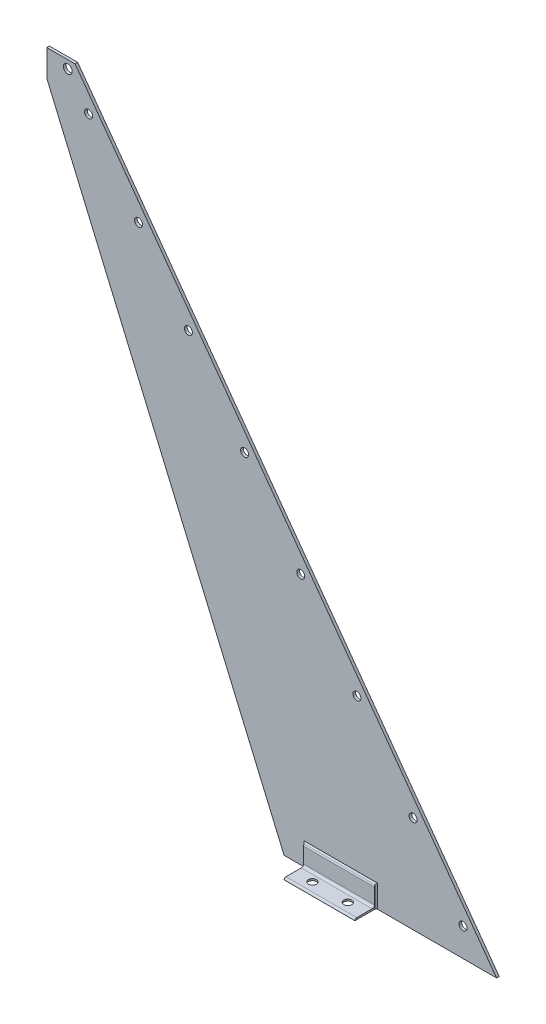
ISO-10303-21;
HEADER;
FILE_DESCRIPTION(('STEP AP214'),'2;1');
FILE_NAME('part.step','',(''),(''),'','','');
FILE_SCHEMA(('AUTOMOTIVE_DESIGN { 1 0 10303 214 1 1 1 1 }'));
ENDSEC;
DATA;
#1=APPLICATION_CONTEXT('core data for automotive mechanical design processes');
#2=APPLICATION_PROTOCOL_DEFINITION('international standard','automotive_design',2000,#1);
#3=PRODUCT_CONTEXT('',#1,'mechanical');
#4=PRODUCT('Part','Part','',(#3));
#5=PRODUCT_RELATED_PRODUCT_CATEGORY('part','',(#4));
#6=PRODUCT_DEFINITION_FORMATION('','',#4);
#7=PRODUCT_DEFINITION_CONTEXT('part definition',#1,'design');
#8=PRODUCT_DEFINITION('design','',#6,#7);
#9=PRODUCT_DEFINITION_SHAPE('','',#8);
#10=(LENGTH_UNIT() NAMED_UNIT(*) SI_UNIT(.MILLI.,.METRE.));
#11=(NAMED_UNIT(*) PLANE_ANGLE_UNIT() SI_UNIT($,.RADIAN.));
#12=(NAMED_UNIT(*) SI_UNIT($,.STERADIAN.) SOLID_ANGLE_UNIT());
#13=UNCERTAINTY_MEASURE_WITH_UNIT(LENGTH_MEASURE(1.E-05),#10,'distance_accuracy_value','');
#14=(GEOMETRIC_REPRESENTATION_CONTEXT(3) GLOBAL_UNCERTAINTY_ASSIGNED_CONTEXT((#13)) GLOBAL_UNIT_ASSIGNED_CONTEXT((#10,
#11,#12)) REPRESENTATION_CONTEXT('',''));
#15=CARTESIAN_POINT('',(0.,0.,0.));
#16=DIRECTION('',(0.,0.,1.));
#17=DIRECTION('',(1.,0.,0.));
#18=AXIS2_PLACEMENT_3D('',#15,#16,#17);
#19=CARTESIAN_POINT('',(0.,0.,0.));
#20=DIRECTION('',(0.,0.,-1.));
#21=DIRECTION('',(-1.,0.,0.));
#22=AXIS2_PLACEMENT_3D('',#19,#20,#21);
#23=PLANE('',#22);
#24=CARTESIAN_POINT('',(1492.55962975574,100.97309190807,0.));
#25=DIRECTION('',(0.,0.,1.));
#26=DIRECTION('',(1.,0.,0.));
#27=AXIS2_PLACEMENT_3D('',#24,#25,#26);
#28=CIRCLE('',#27,14.2874999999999);
#29=CARTESIAN_POINT('',(1506.84712975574,100.97309190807,0.));
#30=VERTEX_POINT('',#29);
#31=EDGE_CURVE('E615',#30,#30,#28,.T.);
#32=ORIENTED_EDGE('',*,*,#31,.F.);
#33=EDGE_LOOP('',(#32));
#34=FACE_BOUND('',#33,.T.);
#35=CARTESIAN_POINT('',(1313.55332901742,347.670850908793,0.));
#36=DIRECTION('',(0.,0.,1.));
#37=DIRECTION('',(1.,0.,0.));
#38=AXIS2_PLACEMENT_3D('',#35,#36,#37);
#39=CIRCLE('',#38,14.2874999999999);
#40=CARTESIAN_POINT('',(1327.84082901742,347.670850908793,0.));
#41=VERTEX_POINT('',#40);
#42=EDGE_CURVE('E609',#41,#41,#39,.T.);
#43=ORIENTED_EDGE('',*,*,#42,.F.);
#44=EDGE_LOOP('',(#43));
#45=FACE_BOUND('',#44,.T.);
#46=CARTESIAN_POINT('',(1112.17124068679,625.205829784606,0.));
#47=DIRECTION('',(0.,0.,1.));
#48=DIRECTION('',(1.,0.,0.));
#49=AXIS2_PLACEMENT_3D('',#46,#47,#48);
#50=CIRCLE('',#49,14.2874999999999);
#51=CARTESIAN_POINT('',(1126.45874068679,625.205829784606,0.));
#52=VERTEX_POINT('',#51);
#53=EDGE_CURVE('E603',#52,#52,#50,.T.);
#54=ORIENTED_EDGE('',*,*,#53,.F.);
#55=EDGE_LOOP('',(#54));
#56=FACE_BOUND('',#55,.T.);
#57=CARTESIAN_POINT('',(910.789152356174,902.74080866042,0.));
#58=DIRECTION('',(0.,0.,1.));
#59=DIRECTION('',(1.,0.,0.));
#60=AXIS2_PLACEMENT_3D('',#57,#58,#59);
#61=CIRCLE('',#60,14.2875);
#62=CARTESIAN_POINT('',(925.076652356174,902.74080866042,0.));
#63=VERTEX_POINT('',#62);
#64=EDGE_CURVE('E597',#63,#63,#61,.T.);
#65=ORIENTED_EDGE('',*,*,#64,.F.);
#66=EDGE_LOOP('',(#65));
#67=FACE_BOUND('',#66,.T.);
#68=CARTESIAN_POINT('',(709.407064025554,1180.27578753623,0.));
#69=DIRECTION('',(0.,0.,1.));
#70=DIRECTION('',(1.,0.,0.));
#71=AXIS2_PLACEMENT_3D('',#68,#69,#70);
#72=CIRCLE('',#71,14.2875);
#73=CARTESIAN_POINT('',(723.694564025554,1180.27578753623,0.));
#74=VERTEX_POINT('',#73);
#75=EDGE_CURVE('E591',#74,#74,#72,.T.);
#76=ORIENTED_EDGE('',*,*,#75,.F.);
#77=EDGE_LOOP('',(#76));
#78=FACE_BOUND('',#77,.T.);
#79=CARTESIAN_POINT('',(508.024975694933,1457.81076641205,0.));
#80=DIRECTION('',(0.,0.,1.));
#81=DIRECTION('',(1.,0.,0.));
#82=AXIS2_PLACEMENT_3D('',#79,#80,#81);
#83=CIRCLE('',#82,14.2875);
#84=CARTESIAN_POINT('',(522.312475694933,1457.81076641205,0.));
#85=VERTEX_POINT('',#84);
#86=EDGE_CURVE('E585',#85,#85,#83,.T.);
#87=ORIENTED_EDGE('',*,*,#86,.F.);
#88=EDGE_LOOP('',(#87));
#89=FACE_BOUND('',#88,.T.);
#90=CARTESIAN_POINT('',(150.012374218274,1951.20628441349,0.));
#91=DIRECTION('',(0.,0.,1.));
#92=DIRECTION('',(1.,0.,0.));
#93=AXIS2_PLACEMENT_3D('',#90,#91,#92);
#94=CIRCLE('',#93,14.2875);
#95=CARTESIAN_POINT('',(164.299874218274,1951.20628441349,0.));
#96=VERTEX_POINT('',#95);
#97=EDGE_CURVE('E579',#96,#96,#94,.T.);
#98=ORIENTED_EDGE('',*,*,#97,.F.);
#99=EDGE_LOOP('',(#98));
#100=FACE_BOUND('',#99,.T.);
#101=CARTESIAN_POINT('',(329.018674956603,1704.50852541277,0.));
#102=DIRECTION('',(0.,0.,1.));
#103=DIRECTION('',(1.,0.,0.));
#104=AXIS2_PLACEMENT_3D('',#101,#102,#103);
#105=CIRCLE('',#104,14.2875);
#106=CARTESIAN_POINT('',(343.306174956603,1704.50852541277,0.));
#107=VERTEX_POINT('',#106);
#108=EDGE_CURVE('E573',#107,#107,#105,.T.);
#109=ORIENTED_EDGE('',*,*,#108,.F.);
#110=EDGE_LOOP('',(#109));
#111=FACE_BOUND('',#110,.T.);
#112=CARTESIAN_POINT('',(75.4264155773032,2053.99701733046,0.));
#113=DIRECTION('',(0.,0.,1.));
#114=DIRECTION('',(1.,0.,0.));
#115=AXIS2_PLACEMENT_3D('',#112,#113,#114);
#116=CIRCLE('',#115,15.875);
#117=CARTESIAN_POINT('',(91.3014155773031,2053.99701733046,0.));
#118=VERTEX_POINT('',#117);
#119=EDGE_CURVE('E550',#118,#118,#116,.T.);
#120=ORIENTED_EDGE('',*,*,#119,.F.);
#121=EDGE_LOOP('',(#120));
#122=FACE_BOUND('',#121,.T.);
#123=DIRECTION('',(0.,-1.,0.));
#124=VECTOR('',#123,1.);
#125=CARTESIAN_POINT('',(922.3375,85.3164420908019,0.));
#126=LINE('',#125,#124);
#127=CARTESIAN_POINT('',(922.3375,80.9625,0.));
#128=VERTEX_POINT('',#127);
#129=CARTESIAN_POINT('',(922.3375,0.,0.));
#130=VERTEX_POINT('',#129);
#131=EDGE_CURVE('E558',#128,#130,#126,.T.);
#132=ORIENTED_EDGE('',*,*,#131,.F.);
#133=DIRECTION('',(1.,0.,0.));
#134=VECTOR('',#133,1.);
#135=CARTESIAN_POINT('',(922.3375,80.9625,0.));
#136=LINE('',#135,#134);
#137=CARTESIAN_POINT('',(1185.8625,80.9625,0.));
#138=VERTEX_POINT('',#137);
#139=EDGE_CURVE('E414',#128,#138,#136,.T.);
#140=ORIENTED_EDGE('',*,*,#139,.T.);
#141=DIRECTION('',(0.,-1.,0.));
#142=VECTOR('',#141,1.);
#143=CARTESIAN_POINT('',(1185.8625,80.9625,0.));
#144=LINE('',#143,#142);
#145=CARTESIAN_POINT('',(1185.8625,0.,0.));
#146=VERTEX_POINT('',#145);
#147=EDGE_CURVE('E551',#138,#146,#144,.T.);
#148=ORIENTED_EDGE('',*,*,#147,.T.);
#149=DIRECTION('',(1.,0.,0.));
#150=VECTOR('',#149,1.);
#151=CARTESIAN_POINT('',(1612.9,0.,0.));
#152=LINE('',#151,#150);
#153=CARTESIAN_POINT('',(1612.9,0.,0.));
#154=VERTEX_POINT('',#153);
#155=EDGE_CURVE('E530',#146,#154,#152,.T.);
#156=ORIENTED_EDGE('',*,*,#155,.T.);
#157=DIRECTION('',(-0.587291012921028,0.809375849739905,0.));
#158=VECTOR('',#157,1.);
#159=CARTESIAN_POINT('',(101.6,2082.8,0.));
#160=LINE('',#159,#158);
#161=CARTESIAN_POINT('',(101.6,2082.8,0.));
#162=VERTEX_POINT('',#161);
#163=EDGE_CURVE('E529',#154,#162,#160,.T.);
#164=ORIENTED_EDGE('',*,*,#163,.T.);
#165=DIRECTION('',(-1.,0.,0.));
#166=VECTOR('',#165,1.);
#167=CARTESIAN_POINT('',(0.,2082.8,0.));
#168=LINE('',#167,#166);
#169=CARTESIAN_POINT('',(0.,2082.8,0.));
#170=VERTEX_POINT('',#169);
#171=EDGE_CURVE('E771',#162,#170,#168,.T.);
#172=ORIENTED_EDGE('',*,*,#171,.T.);
#173=DIRECTION('',(0.,-1.,0.));
#174=VECTOR('',#173,1.);
#175=CARTESIAN_POINT('',(0.,1987.55,0.));
#176=LINE('',#175,#174);
#177=CARTESIAN_POINT('',(0.,1987.55,0.));
#178=VERTEX_POINT('',#177);
#179=EDGE_CURVE('E772',#170,#178,#176,.T.);
#180=ORIENTED_EDGE('',*,*,#179,.T.);
#181=DIRECTION('',(0.393564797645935,-0.919296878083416,0.));
#182=VECTOR('',#181,1.);
#183=CARTESIAN_POINT('',(850.9,0.,0.));
#184=LINE('',#183,#182);
#185=CARTESIAN_POINT('',(850.9,0.,0.));
#186=VERTEX_POINT('',#185);
#187=EDGE_CURVE('E495',#178,#186,#184,.T.);
#188=ORIENTED_EDGE('',*,*,#187,.T.);
#189=EDGE_CURVE('E525',#186,#130,#152,.T.);
#190=ORIENTED_EDGE('',*,*,#189,.T.);
#191=EDGE_LOOP('',(#132,#140,#148,#156,#164,#172,#180,#188,#190));
#192=FACE_BOUND('',#191,.T.);
#193=ADVANCED_FACE('F363',(#34,#45,#56,#67,#78,#89,#100,#111,#122,#192),#23,.F.);
#194=CARTESIAN_POINT('',(1181.1,69.85,0.));
#195=DIRECTION('',(-1.,0.,0.));
#196=DIRECTION('',(0.,0.,1.));
#197=AXIS2_PLACEMENT_3D('',#194,#195,#196);
#198=PLANE('',#197);
#199=DIRECTION('',(0.,-1.,0.));
#200=VECTOR('',#199,1.);
#201=CARTESIAN_POINT('',(1181.1,76.2,4.7625));
#202=LINE('',#201,#200);
#203=CARTESIAN_POINT('',(1181.1,74.050130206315,4.7625));
#204=VERTEX_POINT('',#203);
#205=CARTESIAN_POINT('',(1181.1,0.,4.76249999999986));
#206=VERTEX_POINT('',#205);
#207=EDGE_CURVE('E12',#204,#206,#202,.T.);
#208=ORIENTED_EDGE('',*,*,#207,.F.);
#209=CARTESIAN_POINT('',(1181.1,69.85,0.));
#210=DIRECTION('',(1.,0.,0.));
#211=DIRECTION('',(0.,0.,1.));
#212=AXIS2_PLACEMENT_3D('',#209,#210,#211);
#213=CIRCLE('',#212,6.35);
#214=CARTESIAN_POINT('',(1181.1,69.85,6.35));
#215=VERTEX_POINT('',#214);
#216=EDGE_CURVE('E644',#204,#215,#213,.T.);
#217=ORIENTED_EDGE('',*,*,#216,.T.);
#218=DIRECTION('',(0.,-1.,0.));
#219=VECTOR('',#218,1.);
#220=CARTESIAN_POINT('',(1181.1,69.85,6.35));
#221=LINE('',#220,#219);
#222=CARTESIAN_POINT('',(1181.1,14.2875,6.34999999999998));
#223=VERTEX_POINT('',#222);
#224=EDGE_CURVE('E647',#215,#223,#221,.T.);
#225=ORIENTED_EDGE('',*,*,#224,.T.);
#226=CARTESIAN_POINT('',(1181.1,14.2875,14.2875));
#227=DIRECTION('',(-1.,0.,0.));
#228=DIRECTION('',(0.,0.,-1.));
#229=AXIS2_PLACEMENT_3D('',#226,#227,#228);
#230=CIRCLE('',#229,7.9375);
#231=CARTESIAN_POINT('',(1181.1,6.35,14.2875));
#232=VERTEX_POINT('',#231);
#233=EDGE_CURVE('E649',#223,#232,#230,.T.);
#234=ORIENTED_EDGE('',*,*,#233,.T.);
#235=DIRECTION('',(0.,0.,1.));
#236=VECTOR('',#235,1.);
#237=CARTESIAN_POINT('',(1181.1,6.34999999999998,69.85));
#238=LINE('',#237,#236);
#239=CARTESIAN_POINT('',(1181.1,6.34999999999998,69.85));
#240=VERTEX_POINT('',#239);
#241=EDGE_CURVE('E651',#232,#240,#238,.T.);
#242=ORIENTED_EDGE('',*,*,#241,.T.);
#243=CARTESIAN_POINT('',(1181.1,0.,69.85));
#244=DIRECTION('',(1.,0.,0.));
#245=DIRECTION('',(0.,0.,-1.));
#246=AXIS2_PLACEMENT_3D('',#243,#244,#245);
#247=CIRCLE('',#246,6.35);
#248=CARTESIAN_POINT('',(1181.1,0.,76.2));
#249=VERTEX_POINT('',#248);
#250=EDGE_CURVE('E653',#240,#249,#247,.T.);
#251=ORIENTED_EDGE('',*,*,#250,.T.);
#252=DIRECTION('',(0.,0.,-1.));
#253=VECTOR('',#252,1.);
#254=CARTESIAN_POINT('',(1181.1,0.,0.));
#255=LINE('',#254,#253);
#256=EDGE_CURVE('E531',#249,#206,#255,.T.);
#257=ORIENTED_EDGE('',*,*,#256,.T.);
#258=EDGE_LOOP('',(#208,#217,#225,#234,#242,#251,#257));
#259=FACE_BOUND('',#258,.T.);
#260=ADVANCED_FACE('F694',(#259),#198,.F.);
#261=CARTESIAN_POINT('',(927.1,69.85,0.));
#262=DIRECTION('',(-1.,0.,0.));
#263=DIRECTION('',(0.,0.,1.));
#264=AXIS2_PLACEMENT_3D('',#261,#262,#263);
#265=PLANE('',#264);
#266=CARTESIAN_POINT('',(927.1,69.85,0.));
#267=DIRECTION('',(1.,0.,0.));
#268=DIRECTION('',(0.,0.,1.));
#269=AXIS2_PLACEMENT_3D('',#266,#267,#268);
#270=CIRCLE('',#269,6.35);
#271=CARTESIAN_POINT('',(927.1,74.050130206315,4.7625));
#272=VERTEX_POINT('',#271);
#273=CARTESIAN_POINT('',(927.1,69.85,6.35));
#274=VERTEX_POINT('',#273);
#275=EDGE_CURVE('E633',#272,#274,#270,.T.);
#276=ORIENTED_EDGE('',*,*,#275,.F.);
#277=DIRECTION('',(0.,-1.,0.));
#278=VECTOR('',#277,1.);
#279=CARTESIAN_POINT('',(927.1,85.3164420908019,4.7625));
#280=LINE('',#279,#278);
#281=CARTESIAN_POINT('',(927.1,0.,4.7625));
#282=VERTEX_POINT('',#281);
#283=EDGE_CURVE('E373',#272,#282,#280,.T.);
#284=ORIENTED_EDGE('',*,*,#283,.T.);
#285=DIRECTION('',(0.,0.,-1.));
#286=VECTOR('',#285,1.);
#287=CARTESIAN_POINT('',(927.1,0.,0.));
#288=LINE('',#287,#286);
#289=CARTESIAN_POINT('',(927.1,0.,76.2));
#290=VERTEX_POINT('',#289);
#291=EDGE_CURVE('E643',#290,#282,#288,.T.);
#292=ORIENTED_EDGE('',*,*,#291,.F.);
#293=CARTESIAN_POINT('',(927.1,0.,69.85));
#294=DIRECTION('',(1.,0.,0.));
#295=DIRECTION('',(0.,0.,-1.));
#296=AXIS2_PLACEMENT_3D('',#293,#294,#295);
#297=CIRCLE('',#296,6.35);
#298=CARTESIAN_POINT('',(927.1,6.34999999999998,69.85));
#299=VERTEX_POINT('',#298);
#300=EDGE_CURVE('E641',#299,#290,#297,.T.);
#301=ORIENTED_EDGE('',*,*,#300,.F.);
#302=DIRECTION('',(0.,0.,1.));
#303=VECTOR('',#302,1.);
#304=CARTESIAN_POINT('',(927.1,6.34999999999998,69.85));
#305=LINE('',#304,#303);
#306=CARTESIAN_POINT('',(927.1,6.35,14.2875));
#307=VERTEX_POINT('',#306);
#308=EDGE_CURVE('E639',#307,#299,#305,.T.);
#309=ORIENTED_EDGE('',*,*,#308,.F.);
#310=CARTESIAN_POINT('',(927.1,14.2875,14.2875));
#311=DIRECTION('',(-1.,0.,0.));
#312=DIRECTION('',(0.,0.,-1.));
#313=AXIS2_PLACEMENT_3D('',#310,#311,#312);
#314=CIRCLE('',#313,7.9375);
#315=CARTESIAN_POINT('',(927.1,14.2875,6.34999999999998));
#316=VERTEX_POINT('',#315);
#317=EDGE_CURVE('E637',#316,#307,#314,.T.);
#318=ORIENTED_EDGE('',*,*,#317,.F.);
#319=DIRECTION('',(0.,-1.,0.));
#320=VECTOR('',#319,1.);
#321=CARTESIAN_POINT('',(927.1,69.85,6.35));
#322=LINE('',#321,#320);
#323=EDGE_CURVE('E635',#274,#316,#322,.T.);
#324=ORIENTED_EDGE('',*,*,#323,.F.);
#325=EDGE_LOOP('',(#276,#284,#292,#301,#309,#318,#324));
#326=FACE_BOUND('',#325,.T.);
#327=ADVANCED_FACE('F688',(#326),#265,.T.);
#328=CARTESIAN_POINT('',(1612.9,0.,-9.525));
#329=DIRECTION('',(0.,-1.,0.));
#330=DIRECTION('',(0.,0.,-1.));
#331=AXIS2_PLACEMENT_3D('',#328,#329,#330);
#332=PLANE('',#331);
#333=ORIENTED_EDGE('',*,*,#155,.F.);
#334=DIRECTION('',(0.707106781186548,0.,-0.707106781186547));
#335=VECTOR('',#334,1.);
#336=CARTESIAN_POINT('',(1098.50460467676,0.,87.3578953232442));
#337=LINE('',#336,#335);
#338=EDGE_CURVE('E548',#206,#146,#337,.T.);
#339=ORIENTED_EDGE('',*,*,#338,.F.);
#340=ORIENTED_EDGE('',*,*,#256,.F.);
#341=DIRECTION('',(-1.,0.,0.));
#342=VECTOR('',#341,1.);
#343=CARTESIAN_POINT('',(1181.1,0.,76.2));
#344=LINE('',#343,#342);
#345=EDGE_CURVE('E655',#249,#290,#344,.T.);
#346=ORIENTED_EDGE('',*,*,#345,.T.);
#347=ORIENTED_EDGE('',*,*,#291,.T.);
#348=DIRECTION('',(-0.707106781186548,0.,-0.707106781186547));
#349=VECTOR('',#348,1.);
#350=CARTESIAN_POINT('',(922.3375,0.,0.));
#351=LINE('',#350,#349);
#352=EDGE_CURVE('E382',#282,#130,#351,.T.);
#353=ORIENTED_EDGE('',*,*,#352,.T.);
#354=ORIENTED_EDGE('',*,*,#189,.F.);
#355=DIRECTION('',(0.,0.,1.));
#356=VECTOR('',#355,1.);
#357=CARTESIAN_POINT('',(850.9,0.,-9.525));
#358=LINE('',#357,#356);
#359=CARTESIAN_POINT('',(850.9,0.,-9.525));
#360=VERTEX_POINT('',#359);
#361=EDGE_CURVE('E499',#360,#186,#358,.T.);
#362=ORIENTED_EDGE('',*,*,#361,.F.);
#363=DIRECTION('',(1.,0.,0.));
#364=VECTOR('',#363,1.);
#365=CARTESIAN_POINT('',(1612.9,0.,-9.525));
#366=LINE('',#365,#364);
#367=CARTESIAN_POINT('',(1612.9,0.,-9.525));
#368=VERTEX_POINT('',#367);
#369=EDGE_CURVE('E514',#360,#368,#366,.T.);
#370=ORIENTED_EDGE('',*,*,#369,.T.);
#371=DIRECTION('',(0.,0.,1.));
#372=VECTOR('',#371,1.);
#373=CARTESIAN_POINT('',(1612.9,0.,-9.525));
#374=LINE('',#373,#372);
#375=EDGE_CURVE('E515',#368,#154,#374,.T.);
#376=ORIENTED_EDGE('',*,*,#375,.T.);
#377=EDGE_LOOP('',(#333,#339,#340,#346,#347,#353,#354,#362,#370,#376));
#378=FACE_BOUND('',#377,.T.);
#379=CARTESIAN_POINT('',(1117.6,0.,38.1));
#380=DIRECTION('',(0.,-1.,0.));
#381=DIRECTION('',(0.,0.,-1.));
#382=AXIS2_PLACEMENT_3D('',#379,#380,#381);
#383=CIRCLE('',#382,14.2874999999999);
#384=CARTESIAN_POINT('',(1117.6,0.,23.8125000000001));
#385=VERTEX_POINT('',#384);
#386=EDGE_CURVE('E624',#385,#385,#383,.T.);
#387=ORIENTED_EDGE('',*,*,#386,.F.);
#388=EDGE_LOOP('',(#387));
#389=FACE_BOUND('',#388,.T.);
#390=CARTESIAN_POINT('',(990.6,0.,38.1));
#391=DIRECTION('',(0.,-1.,0.));
#392=DIRECTION('',(0.,0.,-1.));
#393=AXIS2_PLACEMENT_3D('',#390,#391,#392);
#394=CIRCLE('',#393,14.2875);
#395=CARTESIAN_POINT('',(990.6,0.,23.8125));
#396=VERTEX_POINT('',#395);
#397=EDGE_CURVE('E630',#396,#396,#394,.T.);
#398=ORIENTED_EDGE('',*,*,#397,.F.);
#399=EDGE_LOOP('',(#398));
#400=FACE_BOUND('',#399,.T.);
#401=ADVANCED_FACE('F365',(#378,#389,#400),#332,.T.);
#402=CARTESIAN_POINT('',(850.9,0.,-9.525));
#403=DIRECTION('',(-0.919296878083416,-0.393564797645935,0.));
#404=DIRECTION('',(0.393564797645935,-0.919296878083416,0.));
#405=AXIS2_PLACEMENT_3D('',#402,#403,#404);
#406=PLANE('',#405);
#407=ORIENTED_EDGE('',*,*,#187,.F.);
#408=DIRECTION('',(0.,0.,1.));
#409=VECTOR('',#408,1.);
#410=CARTESIAN_POINT('',(0.,1987.55,-9.525));
#411=LINE('',#410,#409);
#412=CARTESIAN_POINT('',(0.,1987.55,-9.525));
#413=VERTEX_POINT('',#412);
#414=EDGE_CURVE('E489',#413,#178,#411,.T.);
#415=ORIENTED_EDGE('',*,*,#414,.F.);
#416=DIRECTION('',(0.393564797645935,-0.919296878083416,0.));
#417=VECTOR('',#416,1.);
#418=CARTESIAN_POINT('',(850.9,0.,-9.525));
#419=LINE('',#418,#417);
#420=EDGE_CURVE('E493',#413,#360,#419,.T.);
#421=ORIENTED_EDGE('',*,*,#420,.T.);
#422=ORIENTED_EDGE('',*,*,#361,.T.);
#423=EDGE_LOOP('',(#407,#415,#421,#422));
#424=FACE_BOUND('',#423,.T.);
#425=ADVANCED_FACE('F491',(#424),#406,.T.);
#426=CARTESIAN_POINT('',(0.,1987.55,-9.525));
#427=DIRECTION('',(-1.,0.,0.));
#428=DIRECTION('',(0.,0.,1.));
#429=AXIS2_PLACEMENT_3D('',#426,#427,#428);
#430=PLANE('',#429);
#431=ORIENTED_EDGE('',*,*,#179,.F.);
#432=DIRECTION('',(0.,0.,1.));
#433=VECTOR('',#432,1.);
#434=CARTESIAN_POINT('',(0.,2082.8,-9.525));
#435=LINE('',#434,#433);
#436=CARTESIAN_POINT('',(0.,2082.8,-9.525));
#437=VERTEX_POINT('',#436);
#438=EDGE_CURVE('E500',#437,#170,#435,.T.);
#439=ORIENTED_EDGE('',*,*,#438,.F.);
#440=DIRECTION('',(0.,-1.,0.));
#441=VECTOR('',#440,1.);
#442=CARTESIAN_POINT('',(0.,1987.55,-9.525));
#443=LINE('',#442,#441);
#444=EDGE_CURVE('E503',#437,#413,#443,.T.);
#445=ORIENTED_EDGE('',*,*,#444,.T.);
#446=ORIENTED_EDGE('',*,*,#414,.T.);
#447=EDGE_LOOP('',(#431,#439,#445,#446));
#448=FACE_BOUND('',#447,.T.);
#449=ADVANCED_FACE('F504',(#448),#430,.T.);
#450=CARTESIAN_POINT('',(0.,2082.8,-9.525));
#451=DIRECTION('',(0.,1.,0.));
#452=DIRECTION('',(0.,0.,1.));
#453=AXIS2_PLACEMENT_3D('',#450,#451,#452);
#454=PLANE('',#453);
#455=ORIENTED_EDGE('',*,*,#171,.F.);
#456=DIRECTION('',(0.,0.,1.));
#457=VECTOR('',#456,1.);
#458=CARTESIAN_POINT('',(101.6,2082.8,-9.525));
#459=LINE('',#458,#457);
#460=CARTESIAN_POINT('',(101.6,2082.8,-9.525));
#461=VERTEX_POINT('',#460);
#462=EDGE_CURVE('E518',#461,#162,#459,.T.);
#463=ORIENTED_EDGE('',*,*,#462,.F.);
#464=DIRECTION('',(-1.,0.,0.));
#465=VECTOR('',#464,1.);
#466=CARTESIAN_POINT('',(0.,2082.8,-9.525));
#467=LINE('',#466,#465);
#468=EDGE_CURVE('E508',#461,#437,#467,.T.);
#469=ORIENTED_EDGE('',*,*,#468,.T.);
#470=ORIENTED_EDGE('',*,*,#438,.T.);
#471=EDGE_LOOP('',(#455,#463,#469,#470));
#472=FACE_BOUND('',#471,.T.);
#473=ADVANCED_FACE('F762',(#472),#454,.T.);
#474=CARTESIAN_POINT('',(101.6,2082.8,-9.525));
#475=DIRECTION('',(0.809375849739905,0.587291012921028,0.));
#476=DIRECTION('',(-0.587291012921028,0.809375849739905,0.));
#477=AXIS2_PLACEMENT_3D('',#474,#475,#476);
#478=PLANE('',#477);
#479=ORIENTED_EDGE('',*,*,#163,.F.);
#480=ORIENTED_EDGE('',*,*,#375,.F.);
#481=DIRECTION('',(-0.587291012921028,0.809375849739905,0.));
#482=VECTOR('',#481,1.);
#483=CARTESIAN_POINT('',(101.6,2082.8,-9.525));
#484=LINE('',#483,#482);
#485=EDGE_CURVE('E777',#368,#461,#484,.T.);
#486=ORIENTED_EDGE('',*,*,#485,.T.);
#487=ORIENTED_EDGE('',*,*,#462,.T.);
#488=EDGE_LOOP('',(#479,#480,#486,#487));
#489=FACE_BOUND('',#488,.T.);
#490=ADVANCED_FACE('F756',(#489),#478,.T.);
#491=CARTESIAN_POINT('',(0.,0.,-9.525));
#492=DIRECTION('',(0.,0.,-1.));
#493=DIRECTION('',(-1.,0.,0.));
#494=AXIS2_PLACEMENT_3D('',#491,#492,#493);
#495=PLANE('',#494);
#496=CARTESIAN_POINT('',(75.4264155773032,2053.99701733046,-9.525));
#497=DIRECTION('',(0.,0.,1.));
#498=DIRECTION('',(1.,0.,0.));
#499=AXIS2_PLACEMENT_3D('',#496,#497,#498);
#500=CIRCLE('',#499,15.875);
#501=CARTESIAN_POINT('',(91.3014155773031,2053.99701733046,-9.525));
#502=VERTEX_POINT('',#501);
#503=EDGE_CURVE('E570',#502,#502,#500,.T.);
#504=ORIENTED_EDGE('',*,*,#503,.T.);
#505=EDGE_LOOP('',(#504));
#506=FACE_BOUND('',#505,.T.);
#507=CARTESIAN_POINT('',(329.018674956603,1704.50852541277,-9.525));
#508=DIRECTION('',(0.,0.,1.));
#509=DIRECTION('',(1.,0.,0.));
#510=AXIS2_PLACEMENT_3D('',#507,#508,#509);
#511=CIRCLE('',#510,14.2875);
#512=CARTESIAN_POINT('',(343.306174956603,1704.50852541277,-9.525));
#513=VERTEX_POINT('',#512);
#514=EDGE_CURVE('E576',#513,#513,#511,.T.);
#515=ORIENTED_EDGE('',*,*,#514,.T.);
#516=EDGE_LOOP('',(#515));
#517=FACE_BOUND('',#516,.T.);
#518=CARTESIAN_POINT('',(150.012374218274,1951.20628441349,-9.525));
#519=DIRECTION('',(0.,0.,1.));
#520=DIRECTION('',(1.,0.,0.));
#521=AXIS2_PLACEMENT_3D('',#518,#519,#520);
#522=CIRCLE('',#521,14.2875);
#523=CARTESIAN_POINT('',(164.299874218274,1951.20628441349,-9.525));
#524=VERTEX_POINT('',#523);
#525=EDGE_CURVE('E582',#524,#524,#522,.T.);
#526=ORIENTED_EDGE('',*,*,#525,.T.);
#527=EDGE_LOOP('',(#526));
#528=FACE_BOUND('',#527,.T.);
#529=CARTESIAN_POINT('',(508.024975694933,1457.81076641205,-9.525));
#530=DIRECTION('',(0.,0.,1.));
#531=DIRECTION('',(1.,0.,0.));
#532=AXIS2_PLACEMENT_3D('',#529,#530,#531);
#533=CIRCLE('',#532,14.2875);
#534=CARTESIAN_POINT('',(522.312475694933,1457.81076641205,-9.525));
#535=VERTEX_POINT('',#534);
#536=EDGE_CURVE('E588',#535,#535,#533,.T.);
#537=ORIENTED_EDGE('',*,*,#536,.T.);
#538=EDGE_LOOP('',(#537));
#539=FACE_BOUND('',#538,.T.);
#540=CARTESIAN_POINT('',(709.407064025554,1180.27578753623,-9.525));
#541=DIRECTION('',(0.,0.,1.));
#542=DIRECTION('',(1.,0.,0.));
#543=AXIS2_PLACEMENT_3D('',#540,#541,#542);
#544=CIRCLE('',#543,14.2875);
#545=CARTESIAN_POINT('',(723.694564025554,1180.27578753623,-9.525));
#546=VERTEX_POINT('',#545);
#547=EDGE_CURVE('E594',#546,#546,#544,.T.);
#548=ORIENTED_EDGE('',*,*,#547,.T.);
#549=EDGE_LOOP('',(#548));
#550=FACE_BOUND('',#549,.T.);
#551=CARTESIAN_POINT('',(910.789152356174,902.74080866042,-9.525));
#552=DIRECTION('',(0.,0.,1.));
#553=DIRECTION('',(1.,0.,0.));
#554=AXIS2_PLACEMENT_3D('',#551,#552,#553);
#555=CIRCLE('',#554,14.2875);
#556=CARTESIAN_POINT('',(925.076652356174,902.74080866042,-9.525));
#557=VERTEX_POINT('',#556);
#558=EDGE_CURVE('E600',#557,#557,#555,.T.);
#559=ORIENTED_EDGE('',*,*,#558,.T.);
#560=EDGE_LOOP('',(#559));
#561=FACE_BOUND('',#560,.T.);
#562=CARTESIAN_POINT('',(1112.17124068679,625.205829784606,-9.525));
#563=DIRECTION('',(0.,0.,1.));
#564=DIRECTION('',(1.,0.,0.));
#565=AXIS2_PLACEMENT_3D('',#562,#563,#564);
#566=CIRCLE('',#565,14.2874999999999);
#567=CARTESIAN_POINT('',(1126.45874068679,625.205829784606,-9.525));
#568=VERTEX_POINT('',#567);
#569=EDGE_CURVE('E606',#568,#568,#566,.T.);
#570=ORIENTED_EDGE('',*,*,#569,.T.);
#571=EDGE_LOOP('',(#570));
#572=FACE_BOUND('',#571,.T.);
#573=CARTESIAN_POINT('',(1313.55332901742,347.670850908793,-9.525));
#574=DIRECTION('',(0.,0.,1.));
#575=DIRECTION('',(1.,0.,0.));
#576=AXIS2_PLACEMENT_3D('',#573,#574,#575);
#577=CIRCLE('',#576,14.2874999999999);
#578=CARTESIAN_POINT('',(1327.84082901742,347.670850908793,-9.525));
#579=VERTEX_POINT('',#578);
#580=EDGE_CURVE('E612',#579,#579,#577,.T.);
#581=ORIENTED_EDGE('',*,*,#580,.T.);
#582=EDGE_LOOP('',(#581));
#583=FACE_BOUND('',#582,.T.);
#584=CARTESIAN_POINT('',(1492.55962975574,100.97309190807,-9.525));
#585=DIRECTION('',(0.,0.,1.));
#586=DIRECTION('',(1.,0.,0.));
#587=AXIS2_PLACEMENT_3D('',#584,#585,#586);
#588=CIRCLE('',#587,14.2874999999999);
#589=CARTESIAN_POINT('',(1506.84712975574,100.97309190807,-9.525));
#590=VERTEX_POINT('',#589);
#591=EDGE_CURVE('E618',#590,#590,#588,.T.);
#592=ORIENTED_EDGE('',*,*,#591,.T.);
#593=EDGE_LOOP('',(#592));
#594=FACE_BOUND('',#593,.T.);
#595=ORIENTED_EDGE('',*,*,#369,.F.);
#596=ORIENTED_EDGE('',*,*,#420,.F.);
#597=ORIENTED_EDGE('',*,*,#444,.F.);
#598=ORIENTED_EDGE('',*,*,#468,.F.);
#599=ORIENTED_EDGE('',*,*,#485,.F.);
#600=EDGE_LOOP('',(#595,#596,#597,#598,#599));
#601=FACE_BOUND('',#600,.T.);
#602=ADVANCED_FACE('F511',(#506,#517,#528,#539,#550,#561,#572,#583,#594,#601),#495,.T.);
#603=CARTESIAN_POINT('',(1181.1,69.85,0.));
#604=DIRECTION('',(-1.,0.,0.));
#605=DIRECTION('',(0.,0.,1.));
#606=AXIS2_PLACEMENT_3D('',#603,#604,#605);
#607=CYLINDRICAL_SURFACE('',#606,6.35);
#608=CARTESIAN_POINT('',(927.1,76.2,0.));
#609=VERTEX_POINT('',#608);
#610=EDGE_CURVE('E405',#609,#272,#270,.T.);
#611=ORIENTED_EDGE('',*,*,#610,.T.);
#612=ORIENTED_EDGE('',*,*,#275,.T.);
#613=DIRECTION('',(-1.,0.,0.));
#614=VECTOR('',#613,1.);
#615=CARTESIAN_POINT('',(1181.1,69.85,6.35));
#616=LINE('',#615,#614);
#617=EDGE_CURVE('E536',#215,#274,#616,.T.);
#618=ORIENTED_EDGE('',*,*,#617,.F.);
#619=ORIENTED_EDGE('',*,*,#216,.F.);
#620=CARTESIAN_POINT('',(1181.1,76.2,0.));
#621=VERTEX_POINT('',#620);
#622=EDGE_CURVE('E646',#621,#204,#213,.T.);
#623=ORIENTED_EDGE('',*,*,#622,.F.);
#624=DIRECTION('',(-1.,0.,0.));
#625=VECTOR('',#624,1.);
#626=CARTESIAN_POINT('',(1181.1,76.2,0.));
#627=LINE('',#626,#625);
#628=EDGE_CURVE('E367',#621,#609,#627,.T.);
#629=ORIENTED_EDGE('',*,*,#628,.T.);
#630=EDGE_LOOP('',(#611,#612,#618,#619,#623,#629));
#631=FACE_BOUND('',#630,.T.);
#632=ADVANCED_FACE('F677',(#631),#607,.T.);
#633=CARTESIAN_POINT('',(1181.1,69.85,6.35));
#634=DIRECTION('',(0.,0.,-1.));
#635=DIRECTION('',(0.,1.,0.));
#636=AXIS2_PLACEMENT_3D('',#633,#634,#635);
#637=PLANE('',#636);
#638=ORIENTED_EDGE('',*,*,#323,.T.);
#639=DIRECTION('',(-1.,0.,0.));
#640=VECTOR('',#639,1.);
#641=CARTESIAN_POINT('',(1181.1,14.2875,6.34999999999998));
#642=LINE('',#641,#640);
#643=EDGE_CURVE('E663',#223,#316,#642,.T.);
#644=ORIENTED_EDGE('',*,*,#643,.F.);
#645=ORIENTED_EDGE('',*,*,#224,.F.);
#646=ORIENTED_EDGE('',*,*,#617,.T.);
#647=EDGE_LOOP('',(#638,#644,#645,#646));
#648=FACE_BOUND('',#647,.T.);
#649=ADVANCED_FACE('F691',(#648),#637,.F.);
#650=CARTESIAN_POINT('',(1181.1,14.2875,14.2875));
#651=DIRECTION('',(-1.,0.,0.));
#652=DIRECTION('',(0.,0.,1.));
#653=AXIS2_PLACEMENT_3D('',#650,#651,#652);
#654=CYLINDRICAL_SURFACE('',#653,7.9375);
#655=ORIENTED_EDGE('',*,*,#317,.T.);
#656=DIRECTION('',(-1.,0.,0.));
#657=VECTOR('',#656,1.);
#658=CARTESIAN_POINT('',(1181.1,6.35,14.2875));
#659=LINE('',#658,#657);
#660=EDGE_CURVE('E661',#232,#307,#659,.T.);
#661=ORIENTED_EDGE('',*,*,#660,.F.);
#662=ORIENTED_EDGE('',*,*,#233,.F.);
#663=ORIENTED_EDGE('',*,*,#643,.T.);
#664=EDGE_LOOP('',(#655,#661,#662,#663));
#665=FACE_BOUND('',#664,.T.);
#666=ADVANCED_FACE('F731',(#665),#654,.F.);
#667=CARTESIAN_POINT('',(1181.1,6.34999999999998,69.85));
#668=DIRECTION('',(0.,-1.,0.));
#669=DIRECTION('',(0.,0.,-1.));
#670=AXIS2_PLACEMENT_3D('',#667,#668,#669);
#671=PLANE('',#670);
#672=CARTESIAN_POINT('',(1117.6,6.34999999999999,38.1));
#673=DIRECTION('',(0.,1.,0.));
#674=DIRECTION('',(0.,0.,1.));
#675=AXIS2_PLACEMENT_3D('',#672,#673,#674);
#676=CIRCLE('',#675,14.2874999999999);
#677=CARTESIAN_POINT('',(1117.6,6.34999999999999,52.3874999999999));
#678=VERTEX_POINT('',#677);
#679=EDGE_CURVE('E621',#678,#678,#676,.T.);
#680=ORIENTED_EDGE('',*,*,#679,.F.);
#681=EDGE_LOOP('',(#680));
#682=FACE_BOUND('',#681,.T.);
#683=CARTESIAN_POINT('',(990.6,6.34999999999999,38.1));
#684=DIRECTION('',(0.,1.,0.));
#685=DIRECTION('',(0.,0.,1.));
#686=AXIS2_PLACEMENT_3D('',#683,#684,#685);
#687=CIRCLE('',#686,14.2875);
#688=CARTESIAN_POINT('',(990.6,6.34999999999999,52.3875));
#689=VERTEX_POINT('',#688);
#690=EDGE_CURVE('E627',#689,#689,#687,.T.);
#691=ORIENTED_EDGE('',*,*,#690,.F.);
#692=EDGE_LOOP('',(#691));
#693=FACE_BOUND('',#692,.T.);
#694=ORIENTED_EDGE('',*,*,#308,.T.);
#695=DIRECTION('',(-1.,0.,0.));
#696=VECTOR('',#695,1.);
#697=CARTESIAN_POINT('',(1181.1,6.34999999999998,69.85));
#698=LINE('',#697,#696);
#699=EDGE_CURVE('E658',#240,#299,#698,.T.);
#700=ORIENTED_EDGE('',*,*,#699,.F.);
#701=ORIENTED_EDGE('',*,*,#241,.F.);
#702=ORIENTED_EDGE('',*,*,#660,.T.);
#703=EDGE_LOOP('',(#694,#700,#701,#702));
#704=FACE_BOUND('',#703,.T.);
#705=ADVANCED_FACE('F730',(#682,#693,#704),#671,.F.);
#706=CARTESIAN_POINT('',(1181.1,0.,69.85));
#707=DIRECTION('',(-1.,0.,0.));
#708=DIRECTION('',(0.,0.,1.));
#709=AXIS2_PLACEMENT_3D('',#706,#707,#708);
#710=CYLINDRICAL_SURFACE('',#709,6.35);
#711=ORIENTED_EDGE('',*,*,#300,.T.);
#712=ORIENTED_EDGE('',*,*,#345,.F.);
#713=ORIENTED_EDGE('',*,*,#250,.F.);
#714=ORIENTED_EDGE('',*,*,#699,.T.);
#715=EDGE_LOOP('',(#711,#712,#713,#714));
#716=FACE_BOUND('',#715,.T.);
#717=ADVANCED_FACE('F725',(#716),#710,.T.);
#718=CARTESIAN_POINT('',(990.6,-5.00000000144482E-05,38.1));
#719=DIRECTION('',(0.,1.,0.));
#720=DIRECTION('',(0.,0.,1.));
#721=AXIS2_PLACEMENT_3D('',#718,#719,#720);
#722=CYLINDRICAL_SURFACE('',#721,14.2875);
#723=ORIENTED_EDGE('',*,*,#397,.T.);
#724=EDGE_LOOP('',(#723));
#725=FACE_BOUND('',#724,.T.);
#726=ORIENTED_EDGE('',*,*,#690,.T.);
#727=EDGE_LOOP('',(#726));
#728=FACE_BOUND('',#727,.T.);
#729=ADVANCED_FACE('F833',(#725,#728),#722,.F.);
#730=CARTESIAN_POINT('',(1117.6,-5.00000000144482E-05,38.1));
#731=DIRECTION('',(0.,1.,0.));
#732=DIRECTION('',(0.,0.,1.));
#733=AXIS2_PLACEMENT_3D('',#730,#731,#732);
#734=CYLINDRICAL_SURFACE('',#733,14.2874999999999);
#735=ORIENTED_EDGE('',*,*,#386,.T.);
#736=EDGE_LOOP('',(#735));
#737=FACE_BOUND('',#736,.T.);
#738=ORIENTED_EDGE('',*,*,#679,.T.);
#739=EDGE_LOOP('',(#738));
#740=FACE_BOUND('',#739,.T.);
#741=ADVANCED_FACE('F829',(#737,#740),#734,.F.);
#742=CARTESIAN_POINT('',(1492.55962975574,100.97309190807,-9.525));
#743=DIRECTION('',(0.,0.,1.));
#744=DIRECTION('',(1.,0.,0.));
#745=AXIS2_PLACEMENT_3D('',#742,#743,#744);
#746=CYLINDRICAL_SURFACE('',#745,14.2874999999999);
#747=ORIENTED_EDGE('',*,*,#591,.F.);
#748=EDGE_LOOP('',(#747));
#749=FACE_BOUND('',#748,.T.);
#750=ORIENTED_EDGE('',*,*,#31,.T.);
#751=EDGE_LOOP('',(#750));
#752=FACE_BOUND('',#751,.T.);
#753=ADVANCED_FACE('F825',(#749,#752),#746,.F.);
#754=CARTESIAN_POINT('',(1313.55332901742,347.670850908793,-9.525));
#755=DIRECTION('',(0.,0.,1.));
#756=DIRECTION('',(1.,0.,0.));
#757=AXIS2_PLACEMENT_3D('',#754,#755,#756);
#758=CYLINDRICAL_SURFACE('',#757,14.2874999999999);
#759=ORIENTED_EDGE('',*,*,#580,.F.);
#760=EDGE_LOOP('',(#759));
#761=FACE_BOUND('',#760,.T.);
#762=ORIENTED_EDGE('',*,*,#42,.T.);
#763=EDGE_LOOP('',(#762));
#764=FACE_BOUND('',#763,.T.);
#765=ADVANCED_FACE('F821',(#761,#764),#758,.F.);
#766=CARTESIAN_POINT('',(1112.17124068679,625.205829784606,-9.525));
#767=DIRECTION('',(0.,0.,1.));
#768=DIRECTION('',(1.,0.,0.));
#769=AXIS2_PLACEMENT_3D('',#766,#767,#768);
#770=CYLINDRICAL_SURFACE('',#769,14.2874999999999);
#771=ORIENTED_EDGE('',*,*,#569,.F.);
#772=EDGE_LOOP('',(#771));
#773=FACE_BOUND('',#772,.T.);
#774=ORIENTED_EDGE('',*,*,#53,.T.);
#775=EDGE_LOOP('',(#774));
#776=FACE_BOUND('',#775,.T.);
#777=ADVANCED_FACE('F817',(#773,#776),#770,.F.);
#778=CARTESIAN_POINT('',(910.789152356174,902.74080866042,-9.525));
#779=DIRECTION('',(0.,0.,1.));
#780=DIRECTION('',(1.,0.,0.));
#781=AXIS2_PLACEMENT_3D('',#778,#779,#780);
#782=CYLINDRICAL_SURFACE('',#781,14.2875);
#783=ORIENTED_EDGE('',*,*,#558,.F.);
#784=EDGE_LOOP('',(#783));
#785=FACE_BOUND('',#784,.T.);
#786=ORIENTED_EDGE('',*,*,#64,.T.);
#787=EDGE_LOOP('',(#786));
#788=FACE_BOUND('',#787,.T.);
#789=ADVANCED_FACE('F813',(#785,#788),#782,.F.);
#790=CARTESIAN_POINT('',(709.407064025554,1180.27578753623,-9.525));
#791=DIRECTION('',(0.,0.,1.));
#792=DIRECTION('',(1.,0.,0.));
#793=AXIS2_PLACEMENT_3D('',#790,#791,#792);
#794=CYLINDRICAL_SURFACE('',#793,14.2875);
#795=ORIENTED_EDGE('',*,*,#547,.F.);
#796=EDGE_LOOP('',(#795));
#797=FACE_BOUND('',#796,.T.);
#798=ORIENTED_EDGE('',*,*,#75,.T.);
#799=EDGE_LOOP('',(#798));
#800=FACE_BOUND('',#799,.T.);
#801=ADVANCED_FACE('F809',(#797,#800),#794,.F.);
#802=CARTESIAN_POINT('',(508.024975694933,1457.81076641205,-9.525));
#803=DIRECTION('',(0.,0.,1.));
#804=DIRECTION('',(1.,0.,0.));
#805=AXIS2_PLACEMENT_3D('',#802,#803,#804);
#806=CYLINDRICAL_SURFACE('',#805,14.2875);
#807=ORIENTED_EDGE('',*,*,#536,.F.);
#808=EDGE_LOOP('',(#807));
#809=FACE_BOUND('',#808,.T.);
#810=ORIENTED_EDGE('',*,*,#86,.T.);
#811=EDGE_LOOP('',(#810));
#812=FACE_BOUND('',#811,.T.);
#813=ADVANCED_FACE('F805',(#809,#812),#806,.F.);
#814=CARTESIAN_POINT('',(150.012374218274,1951.20628441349,-9.525));
#815=DIRECTION('',(0.,0.,1.));
#816=DIRECTION('',(1.,0.,0.));
#817=AXIS2_PLACEMENT_3D('',#814,#815,#816);
#818=CYLINDRICAL_SURFACE('',#817,14.2875);
#819=ORIENTED_EDGE('',*,*,#525,.F.);
#820=EDGE_LOOP('',(#819));
#821=FACE_BOUND('',#820,.T.);
#822=ORIENTED_EDGE('',*,*,#97,.T.);
#823=EDGE_LOOP('',(#822));
#824=FACE_BOUND('',#823,.T.);
#825=ADVANCED_FACE('F801',(#821,#824),#818,.F.);
#826=CARTESIAN_POINT('',(329.018674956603,1704.50852541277,-9.525));
#827=DIRECTION('',(0.,0.,1.));
#828=DIRECTION('',(1.,0.,0.));
#829=AXIS2_PLACEMENT_3D('',#826,#827,#828);
#830=CYLINDRICAL_SURFACE('',#829,14.2875);
#831=ORIENTED_EDGE('',*,*,#514,.F.);
#832=EDGE_LOOP('',(#831));
#833=FACE_BOUND('',#832,.T.);
#834=ORIENTED_EDGE('',*,*,#108,.T.);
#835=EDGE_LOOP('',(#834));
#836=FACE_BOUND('',#835,.T.);
#837=ADVANCED_FACE('F797',(#833,#836),#830,.F.);
#838=CARTESIAN_POINT('',(75.4264155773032,2053.99701733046,-9.525));
#839=DIRECTION('',(0.,0.,1.));
#840=DIRECTION('',(1.,0.,0.));
#841=AXIS2_PLACEMENT_3D('',#838,#839,#840);
#842=CYLINDRICAL_SURFACE('',#841,15.875);
#843=ORIENTED_EDGE('',*,*,#503,.F.);
#844=EDGE_LOOP('',(#843));
#845=FACE_BOUND('',#844,.T.);
#846=ORIENTED_EDGE('',*,*,#119,.T.);
#847=EDGE_LOOP('',(#846));
#848=FACE_BOUND('',#847,.T.);
#849=ADVANCED_FACE('F789',(#845,#848),#842,.F.);
#850=CARTESIAN_POINT('',(927.1,85.3164420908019,4.7625));
#851=DIRECTION('',(1.,0.,0.));
#852=DIRECTION('',(0.,0.,-1.));
#853=AXIS2_PLACEMENT_3D('',#850,#851,#852);
#854=PLANE('',#853);
#855=ORIENTED_EDGE('',*,*,#610,.F.);
#856=DIRECTION('',(0.,0.,1.));
#857=VECTOR('',#856,1.);
#858=CARTESIAN_POINT('',(927.1,76.2,4.7625));
#859=LINE('',#858,#857);
#860=CARTESIAN_POINT('',(927.1,76.2,4.7625));
#861=VERTEX_POINT('',#860);
#862=EDGE_CURVE('E565',#609,#861,#859,.T.);
#863=ORIENTED_EDGE('',*,*,#862,.T.);
#864=EDGE_CURVE('E545',#861,#272,#280,.T.);
#865=ORIENTED_EDGE('',*,*,#864,.T.);
#866=EDGE_LOOP('',(#855,#863,#865));
#867=FACE_BOUND('',#866,.T.);
#868=ADVANCED_FACE('F683',(#867),#854,.T.);
#869=CARTESIAN_POINT('',(1181.1,76.2,4.7625));
#870=DIRECTION('',(-1.,0.,0.));
#871=DIRECTION('',(0.,0.,1.));
#872=AXIS2_PLACEMENT_3D('',#869,#870,#871);
#873=PLANE('',#872);
#874=DIRECTION('',(0.,0.,-1.));
#875=VECTOR('',#874,1.);
#876=CARTESIAN_POINT('',(1181.1,76.2,4.7625));
#877=LINE('',#876,#875);
#878=CARTESIAN_POINT('',(1181.1,76.2,4.7625));
#879=VERTEX_POINT('',#878);
#880=EDGE_CURVE('E395',#879,#621,#877,.T.);
#881=ORIENTED_EDGE('',*,*,#880,.T.);
#882=ORIENTED_EDGE('',*,*,#622,.T.);
#883=EDGE_CURVE('E557',#879,#204,#202,.T.);
#884=ORIENTED_EDGE('',*,*,#883,.F.);
#885=EDGE_LOOP('',(#881,#882,#884));
#886=FACE_BOUND('',#885,.T.);
#887=ADVANCED_FACE('F788',(#886),#873,.T.);
#888=CARTESIAN_POINT('',(1098.50460467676,-6.39539532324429,87.3578953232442));
#889=DIRECTION('',(0.707106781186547,0.,0.707106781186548));
#890=DIRECTION('',(0.707106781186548,0.,-0.707106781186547));
#891=AXIS2_PLACEMENT_3D('',#888,#889,#890);
#892=PLANE('',#891);
#893=ORIENTED_EDGE('',*,*,#883,.T.);
#894=ORIENTED_EDGE('',*,*,#207,.T.);
#895=ORIENTED_EDGE('',*,*,#338,.T.);
#896=ORIENTED_EDGE('',*,*,#147,.F.);
#897=DIRECTION('',(-0.577350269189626,-0.577350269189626,0.577350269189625));
#898=VECTOR('',#897,1.);
#899=CARTESIAN_POINT('',(1098.50460467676,-6.39539532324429,87.3578953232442));
#900=LINE('',#899,#898);
#901=EDGE_CURVE('E564',#138,#879,#900,.T.);
#902=ORIENTED_EDGE('',*,*,#901,.T.);
#903=EDGE_LOOP('',(#893,#894,#895,#896,#902));
#904=FACE_BOUND('',#903,.T.);
#905=ADVANCED_FACE('F701',(#904),#892,.T.);
#906=CARTESIAN_POINT('',(927.1,76.2,4.7625));
#907=DIRECTION('',(0.,1.,0.));
#908=DIRECTION('',(0.,0.,1.));
#909=AXIS2_PLACEMENT_3D('',#906,#907,#908);
#910=PLANE('',#909);
#911=ORIENTED_EDGE('',*,*,#880,.F.);
#912=DIRECTION('',(1.,0.,0.));
#913=VECTOR('',#912,1.);
#914=CARTESIAN_POINT('',(927.1,76.2,4.7625));
#915=LINE('',#914,#913);
#916=EDGE_CURVE('E682',#861,#879,#915,.T.);
#917=ORIENTED_EDGE('',*,*,#916,.F.);
#918=ORIENTED_EDGE('',*,*,#862,.F.);
#919=ORIENTED_EDGE('',*,*,#628,.F.);
#920=EDGE_LOOP('',(#911,#917,#918,#919));
#921=FACE_BOUND('',#920,.T.);
#922=ADVANCED_FACE('F680',(#921),#910,.F.);
#923=CARTESIAN_POINT('',(920.886185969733,82.4138140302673,-1.45131403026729));
#924=DIRECTION('',(0.,-0.707106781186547,-0.707106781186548));
#925=DIRECTION('',(0.,0.707106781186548,-0.707106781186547));
#926=AXIS2_PLACEMENT_3D('',#923,#924,#925);
#927=PLANE('',#926);
#928=ORIENTED_EDGE('',*,*,#901,.F.);
#929=ORIENTED_EDGE('',*,*,#139,.F.);
#930=DIRECTION('',(-0.577350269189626,0.577350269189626,-0.577350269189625));
#931=VECTOR('',#930,1.);
#932=CARTESIAN_POINT('',(920.886185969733,82.4138140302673,-1.45131403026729));
#933=LINE('',#932,#931);
#934=EDGE_CURVE('E567',#861,#128,#933,.T.);
#935=ORIENTED_EDGE('',*,*,#934,.F.);
#936=ORIENTED_EDGE('',*,*,#916,.T.);
#937=EDGE_LOOP('',(#928,#929,#935,#936));
#938=FACE_BOUND('',#937,.T.);
#939=ADVANCED_FACE('F711',(#938),#927,.F.);
#940=CARTESIAN_POINT('',(922.3375,85.3164420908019,0.));
#941=DIRECTION('',(-0.707106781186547,0.,0.707106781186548));
#942=DIRECTION('',(0.707106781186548,0.,0.707106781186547));
#943=AXIS2_PLACEMENT_3D('',#940,#941,#942);
#944=PLANE('',#943);
#945=ORIENTED_EDGE('',*,*,#864,.F.);
#946=ORIENTED_EDGE('',*,*,#934,.T.);
#947=ORIENTED_EDGE('',*,*,#131,.T.);
#948=ORIENTED_EDGE('',*,*,#352,.F.);
#949=ORIENTED_EDGE('',*,*,#283,.F.);
#950=EDGE_LOOP('',(#945,#946,#947,#948,#949));
#951=FACE_BOUND('',#950,.T.);
#952=ADVANCED_FACE('F778',(#951),#944,.T.);
#953=CLOSED_SHELL('',(#193,#260,#327,#401,#425,#449,#473,#490,#602,#632,#649,#666,#705,#717,
#729,#741,#753,#765,#777,#789,#801,#813,#825,#837,#849,#868,#887,#905,#922,#939,#952));
#954=MANIFOLD_SOLID_BREP('B2',#953);
#955=ADVANCED_BREP_SHAPE_REPRESENTATION('',(#18,#954),#14);
#956=SHAPE_DEFINITION_REPRESENTATION(#9,#955);
ENDSEC;
END-ISO-10303-21;
